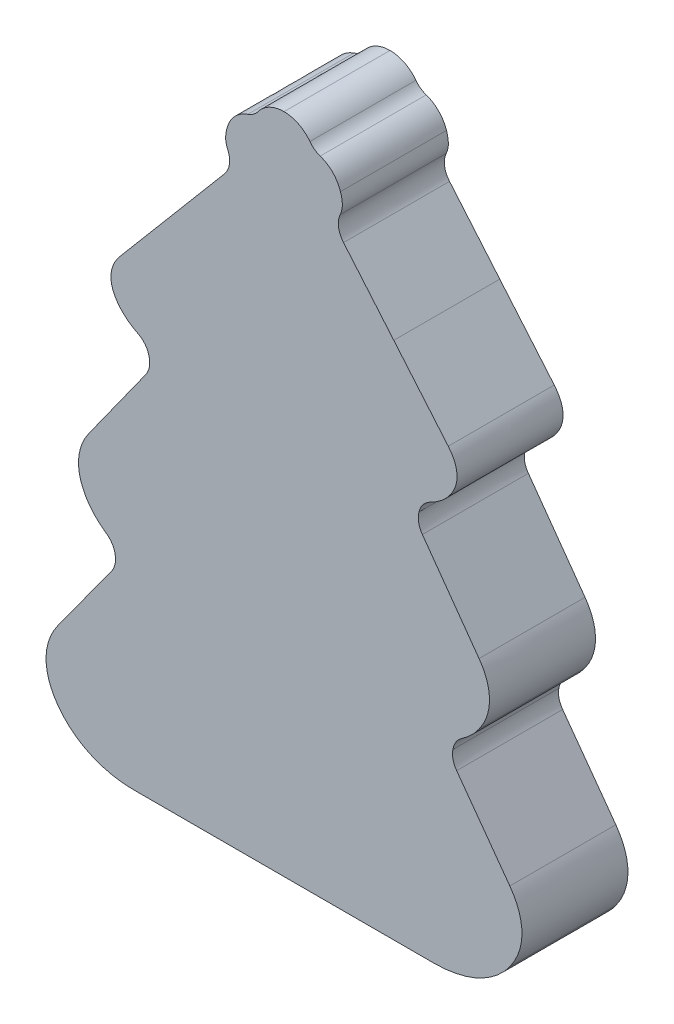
from build123d import *

# Parameters (mm, degrees)
BOSS_EXTRUDE1_DEPTH = 8


with BuildPart() as part:
    # Sketch1 → Boss-Extrude1 (new body)
    with BuildSketch(Plane.XY):
        with BuildLine():
            Line((364.1055996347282, 429.7433953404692), (367.8989971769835, 425.2517946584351))
            add(Edge.make_bspline(
                [(367.8989971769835, 425.2517946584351), (367.8989988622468, 425.25179266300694), (372.0093971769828, 420.38489465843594)],
                knots=[0.024390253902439, 0.024390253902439, 0.024390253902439, 0.0487804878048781, 0.0487804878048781, 0.0487804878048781], degree=2))
            add(Edge.make_bspline(
                [(372.0093971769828, 420.38489465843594), (372.894596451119, 419.33679502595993), (372.894596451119, 418.13699551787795), (372.009396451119, 417.088895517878)],
                knots=[0.0487804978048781, 0.0487804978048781, 0.0487804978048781, 0.0487804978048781, 0.0731707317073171, 0.0731707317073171, 0.0731707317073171, 0.0731707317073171], degree=3))
            add(Edge.make_bspline(
                [(372.009396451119, 417.088895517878), (371.65329655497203, 416.66719572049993), (371.19439674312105, 416.3179958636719), (370.6579967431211, 416.051395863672)],
                knots=[0.07317074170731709, 0.07317074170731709, 0.07317074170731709, 0.07317074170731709, 0.0975609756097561, 0.0975609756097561, 0.0975609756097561, 0.0975609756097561], degree=3))
            add(Edge.make_bspline(
                [(370.6579967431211, 416.051395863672), (370.21429698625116, 415.83089589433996), (369.9198971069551, 415.464696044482), (369.8003971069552, 414.98389604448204)],
                knots=[0.0975609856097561, 0.0975609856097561, 0.0975609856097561, 0.0975609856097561, 0.1219512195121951, 0.1219512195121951, 0.1219512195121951, 0.1219512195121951], degree=3))
            add(Edge.make_bspline(
                [(369.8003971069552, 414.98389604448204), (369.6806972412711, 414.5030962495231), (369.76889720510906, 414.0415964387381), (370.0573972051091, 413.6388964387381)],
                knots=[0.1219512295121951, 0.1219512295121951, 0.1219512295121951, 0.1219512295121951, 0.1463414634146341, 0.1463414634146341, 0.1463414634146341, 0.1463414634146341], degree=3))
            add(Edge.make_bspline(
                [(370.0573972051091, 413.6388964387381), (370.0573989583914, 413.63889399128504), (374.3336972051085, 407.66949643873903)],
                knots=[0.1463414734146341, 0.1463414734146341, 0.1463414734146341, 0.1707317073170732, 0.1707317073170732, 0.1707317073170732], degree=2))
            add(Edge.make_bspline(
                [(374.3336972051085, 407.66949643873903), (375.3848963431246, 406.202296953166), (375.38489634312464, 404.52259764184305), (374.3336963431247, 403.05519764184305)],
                knots=[0.1707317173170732, 0.1707317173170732, 0.1707317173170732, 0.1707317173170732, 0.1951219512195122, 0.1951219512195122, 0.1951219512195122, 0.1951219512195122], degree=3))
            add(Edge.make_bspline(
                [(374.3336963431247, 403.05519764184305), (373.9827964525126, 402.56529787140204), (373.5477966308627, 402.14539804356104), (373.04609663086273, 401.80339804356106)],
                knots=[0.1951219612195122, 0.1951219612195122, 0.1951219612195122, 0.1951219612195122, 0.2195121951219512, 0.2195121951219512, 0.2195121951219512, 0.2195121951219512], degree=3))
            add(Edge.make_bspline(
                [(373.04609663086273, 401.80339804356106), (372.6675968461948, 401.5454981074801), (372.43579694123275, 401.18559825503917), (372.3570969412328, 400.73439825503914)],
                knots=[0.2195122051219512, 0.2195122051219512, 0.2195122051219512, 0.2195122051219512, 0.2439024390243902, 0.2439024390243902, 0.2439024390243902, 0.2439024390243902], degree=3))
            add(Edge.make_bspline(
                [(372.3570969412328, 400.73439825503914), (372.27859704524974, 400.28319845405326), (372.3752970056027, 399.8661986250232), (372.6442970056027, 399.4954986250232)],
                knots=[0.2439024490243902, 0.2439024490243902, 0.2439024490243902, 0.2439024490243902, 0.2682926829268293, 0.2682926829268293, 0.2682926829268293, 0.2682926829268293], degree=3))
            add(Edge.make_bspline(
                [(372.6442970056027, 399.4954986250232), (372.64429865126, 399.495496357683), (376.65809700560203, 393.9653986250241)],
                knots=[0.2682926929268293, 0.2682926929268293, 0.2682926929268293, 0.2926829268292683, 0.2926829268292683, 0.2926829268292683], degree=2))
            add(Edge.make_bspline(
                [(376.65809700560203, 393.9653986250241), (377.8752960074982, 392.2885992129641), (377.8752960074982, 390.369), (376.6580960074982, 388.6919)],
                knots=[0.29268293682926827, 0.29268293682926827, 0.29268293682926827, 0.29268293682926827, 0.3170731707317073, 0.3170731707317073, 0.3170731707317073, 0.3170731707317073], degree=3))
            add(Edge.make_bspline(
                [(376.6580960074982, 388.6919), (375.4408961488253, 387.0148009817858), (373.3511970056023, 386.0552013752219), (370.91669700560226, 386.0552013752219)],
                knots=[0.3170731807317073, 0.3170731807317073, 0.3170731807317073, 0.3170731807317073, 0.3414634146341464, 0.3414634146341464, 0.3414634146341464, 0.3414634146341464], degree=3))
            add(Edge.make_bspline(
                [(370.91669700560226, 386.0552013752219), (370.9166923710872, 386.05520137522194), (359.61299700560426, 386.055201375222)],
                knots=[0.3414634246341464, 0.3414634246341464, 0.3414634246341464, 0.3658536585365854, 0.3658536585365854, 0.3658536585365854], degree=2))
            add(Edge.make_bspline(
                [(359.61299700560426, 386.055201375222), (359.61299237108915, 386.05520137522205), (348.30929700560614, 386.0552013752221)],
                knots=[0.3658536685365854, 0.3658536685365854, 0.3658536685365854, 0.3902439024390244, 0.3902439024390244, 0.3902439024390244], degree=2))
            add(Edge.make_bspline(
                [(348.30929700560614, 386.0552013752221), (345.8747981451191, 386.055201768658), (343.7850990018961, 387.01480137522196), (342.56789900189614, 388.69190137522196)],
                knots=[0.3902439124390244, 0.3902439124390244, 0.3902439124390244, 0.3902439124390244, 0.4146341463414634, 0.4146341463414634, 0.4146341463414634, 0.4146341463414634], degree=3))
            add(Edge.make_bspline(
                [(342.56789900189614, 388.69190137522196), (341.35069999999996, 390.36900078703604), (341.3507, 392.2886), (342.5679, 393.96540000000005)],
                knots=[0.4146341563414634, 0.4146341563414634, 0.4146341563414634, 0.4146341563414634, 0.4390243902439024, 0.4390243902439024, 0.4390243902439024, 0.4390243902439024], degree=3))
            add(Edge.make_bspline(
                [(342.5679, 393.96540000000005), (342.567901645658, 393.965402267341), (346.5817, 399.4955)],
                knots=[0.4390244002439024, 0.4390244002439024, 0.4390244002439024, 0.4634146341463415, 0.4634146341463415, 0.4634146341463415], degree=2))
            add(Edge.make_bspline(
                [(346.5817, 399.4955), (346.8506998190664, 399.8661998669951), (346.9473997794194, 400.28319969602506), (346.8688997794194, 400.73439969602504)],
                knots=[0.4634146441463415, 0.4634146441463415, 0.4634146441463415, 0.4634146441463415, 0.4878048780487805, 0.4878048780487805, 0.4878048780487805, 0.4878048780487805], degree=3))
            add(Edge.make_bspline(
                [(346.8688997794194, 400.73439969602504), (346.79019974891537, 401.1855994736), (346.55839984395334, 401.545499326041), (346.1798998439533, 401.803399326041)],
                knots=[0.48780488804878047, 0.48780488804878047, 0.48780488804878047, 0.48780488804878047, 0.5121951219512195, 0.5121951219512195, 0.5121951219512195, 0.5121951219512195], degree=3))
            add(Edge.make_bspline(
                [(346.1798998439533, 401.803399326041), (345.67820007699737, 402.1453992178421), (345.24320025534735, 402.5654990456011), (344.89230025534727, 403.05519904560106)],
                knots=[0.5121951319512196, 0.5121951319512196, 0.5121951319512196, 0.5121951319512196, 0.5365853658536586, 0.5365853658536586, 0.5365853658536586, 0.5365853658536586], degree=3))
            add(Edge.make_bspline(
                [(344.89230025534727, 403.05519904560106), (343.84130111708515, 404.52259853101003), (343.84110111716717, 406.202297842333), (344.8923011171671, 407.66949784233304)],
                knots=[0.5365853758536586, 0.5365853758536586, 0.5365853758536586, 0.5365853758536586, 0.5609756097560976, 0.5609756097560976, 0.5609756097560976, 0.5609756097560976], degree=3))
            add(Edge.make_bspline(
                [(344.8923011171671, 407.66949784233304), (344.89230287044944, 407.669500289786), (349.1686011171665, 413.6388978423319)],
                knots=[0.5609756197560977, 0.5609756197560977, 0.5609756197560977, 0.5853658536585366, 0.5853658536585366, 0.5853658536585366], degree=2))
            add(Edge.make_bspline(
                [(349.1686011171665, 413.6388978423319), (349.4571009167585, 414.0415977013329), (349.54530088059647, 414.5030975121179), (349.4256008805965, 414.9838975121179)],
                knots=[0.5853658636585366, 0.5853658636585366, 0.5853658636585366, 0.5853658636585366, 0.6097560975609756, 0.6097560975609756, 0.6097560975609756, 0.6097560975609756], degree=3))
            add(Edge.make_bspline(
                [(349.4256008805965, 414.9838975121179), (349.30590085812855, 415.4646972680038), (349.01170097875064, 415.83089711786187), (348.56800097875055, 416.0513971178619)],
                knots=[0.6097561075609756, 0.6097561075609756, 0.6097561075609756, 0.6097561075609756, 0.6341463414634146, 0.6341463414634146, 0.6341463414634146, 0.6341463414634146], degree=3))
            add(Edge.make_bspline(
                [(348.56800097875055, 416.0513971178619), (348.0316012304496, 416.3179970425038), (347.57270141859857, 416.66739689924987), (347.2166014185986, 417.0888968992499)],
                knots=[0.6341463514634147, 0.6341463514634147, 0.6341463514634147, 0.6341463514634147, 0.6585365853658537, 0.6585365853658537, 0.6585365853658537, 0.6585365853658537], degree=3))
            add(Edge.make_bspline(
                [(347.2166014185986, 417.0888968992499), (346.33160214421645, 418.1369965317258), (346.3314021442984, 419.33679603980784), (347.2166021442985, 420.3848960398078)],
                knots=[0.6585365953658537, 0.6585365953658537, 0.6585365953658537, 0.6585365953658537, 0.6829268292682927, 0.6829268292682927, 0.6829268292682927, 0.6829268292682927], degree=3))
            add(Edge.make_bspline(
                [(347.2166021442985, 420.3848960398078), (347.21660382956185, 420.384898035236), (351.3270021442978, 425.25179603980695)],
                knots=[0.6829268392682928, 0.6829268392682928, 0.6829268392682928, 0.7073170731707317, 0.7073170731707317, 0.7073170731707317], degree=2))
            add(Edge.make_bspline(
                [(351.3270021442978, 425.25179603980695), (351.3270036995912, 425.25179788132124), (355.1204021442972, 429.7432960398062)],
                knots=[0.7073170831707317, 0.7073170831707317, 0.7073170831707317, 0.7317073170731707, 0.7317073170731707, 0.7317073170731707], degree=2))
            add(Edge.make_bspline(
                [(355.1204021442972, 429.7432960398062), (355.53100184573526, 430.2294959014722), (355.6240018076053, 430.86449564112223), (355.37000180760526, 431.4481956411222)],
                knots=[0.7317073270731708, 0.7317073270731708, 0.7317073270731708, 0.7317073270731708, 0.7560975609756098, 0.7560975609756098, 0.7560975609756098, 0.7560975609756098], degree=3))
            add(Edge.make_bspline(
                [(355.37000180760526, 431.4481956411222), (355.1929019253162, 431.85509547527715), (355.12580195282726, 432.26439530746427), (355.3511019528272, 432.9582953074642)],
                knots=[0.7560975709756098, 0.7560975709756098, 0.7560975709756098, 0.7560975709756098, 0.7804878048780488, 0.7804878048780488, 0.7804878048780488, 0.7804878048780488], degree=3))
            add(Edge.make_bspline(
                [(355.3511019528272, 432.9582953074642), (355.59380198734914, 433.70599492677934), (356.16340175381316, 434.2728946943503), (356.88010175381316, 434.51799469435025)],
                knots=[0.7804878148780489, 0.7804878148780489, 0.7804878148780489, 0.7804878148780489, 0.8048780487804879, 0.8048780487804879, 0.8048780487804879, 0.8048780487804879], degree=3))
            add(Edge.make_bspline(
                [(356.88010175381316, 434.51799469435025), (357.20390159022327, 434.6286946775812), (357.45250148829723, 434.80919460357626), (357.65770148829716, 435.0828946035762)],
                knots=[0.8048780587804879, 0.8048780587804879, 0.8048780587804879, 0.8048780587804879, 0.8292682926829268, 0.8292682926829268, 0.8292682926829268, 0.8292682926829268], degree=3))
            add(Edge.make_bspline(
                [(357.65770148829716, 435.0828946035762), (358.11220140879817, 435.68869425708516), (358.8273011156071, 436.05519410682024), (359.6132011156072, 436.05519410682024)],
                knots=[0.8292683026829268, 0.8292683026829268, 0.8292683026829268, 0.8292683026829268, 0.8536585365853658, 0.8536585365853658, 0.8536585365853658, 0.8536585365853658], degree=3))
            add(Edge.make_bspline(
                [(359.6132011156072, 436.05519410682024), (360.39910076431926, 436.0551939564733), (361.1141004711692, 435.68849410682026), (361.56850047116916, 435.0828941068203)],
                knots=[0.8536585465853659, 0.8536585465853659, 0.8536585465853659, 0.8536585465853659, 0.8780487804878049, 0.8780487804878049, 0.8780487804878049, 0.8780487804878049], degree=3))
            add(Edge.make_bspline(
                [(361.56850047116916, 435.0828941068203), (361.7737004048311, 434.8091942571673), (362.02230030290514, 434.6284943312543), (362.34590030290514, 434.5177943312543)],
                knots=[0.8780487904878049, 0.8780487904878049, 0.8780487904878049, 0.8780487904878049, 0.9024390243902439, 0.9024390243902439, 0.9024390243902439, 0.9024390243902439], degree=3))
            add(Edge.make_bspline(
                [(362.34590030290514, 434.5177943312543), (363.0623999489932, 434.2725943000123), (363.6321997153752, 433.70599453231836), (363.87489971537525, 432.95839453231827)],
                knots=[0.902439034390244, 0.902439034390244, 0.902439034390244, 0.902439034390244, 0.926829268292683, 0.926829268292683, 0.926829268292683, 0.926829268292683], degree=3))
            add(Edge.make_bspline(
                [(363.87489971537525, 432.95839453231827), (364.1001995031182, 432.26459493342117), (364.0330995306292, 431.8552951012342), (363.8559995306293, 431.4481951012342)],
                knots=[0.926829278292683, 0.926829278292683, 0.926829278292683, 0.926829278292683, 0.9512195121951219, 0.9512195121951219, 0.9512195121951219, 0.9512195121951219], degree=3))
            add(Edge.make_bspline(
                [(363.8559995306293, 431.4481951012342), (363.60209965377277, 430.86469521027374), (363.6949996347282, 430.2295953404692), (364.1055996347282, 429.7433953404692)],
                knots=[0.951219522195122, 0.951219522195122, 0.951219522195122, 0.951219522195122, 1, 1, 1, 1], degree=3))
        make_face()
    extrude(amount=BOSS_EXTRUDE1_DEPTH)


solid = part.part
